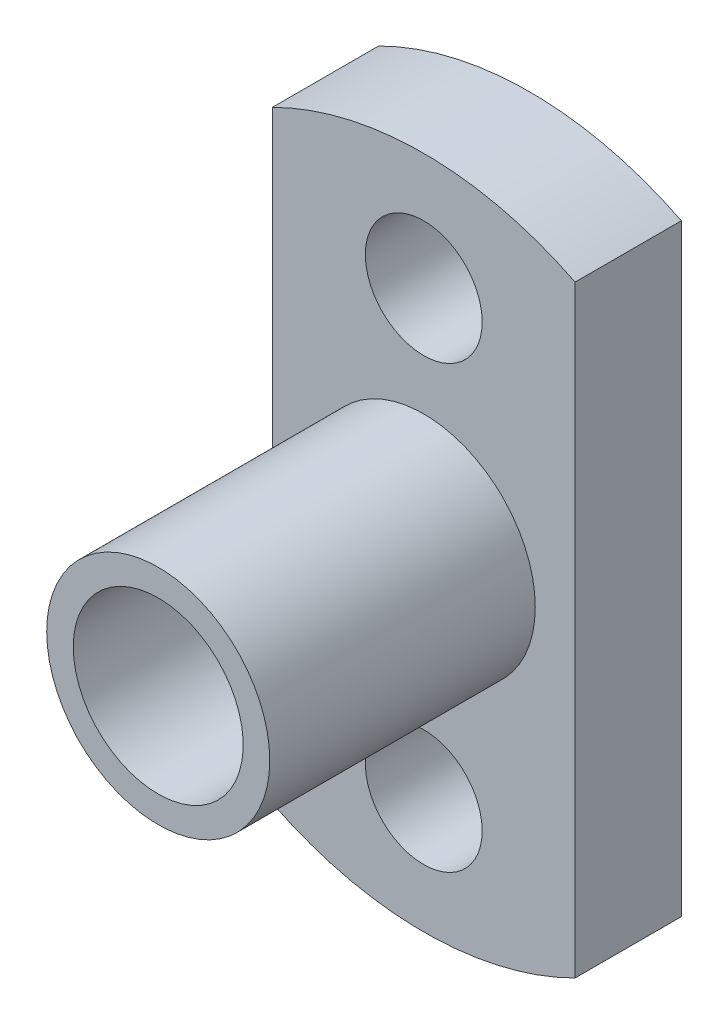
ISO-10303-21;
HEADER;
FILE_DESCRIPTION(('STEP AP214'),'2;1');
FILE_NAME('part.step','',(''),(''),'','','');
FILE_SCHEMA(('AUTOMOTIVE_DESIGN { 1 0 10303 214 1 1 1 1 }'));
ENDSEC;
DATA;
#1=APPLICATION_CONTEXT('core data for automotive mechanical design processes');
#2=APPLICATION_PROTOCOL_DEFINITION('international standard','automotive_design',2000,#1);
#3=PRODUCT_CONTEXT('',#1,'mechanical');
#4=PRODUCT('Part','Part','',(#3));
#5=PRODUCT_RELATED_PRODUCT_CATEGORY('part','',(#4));
#6=PRODUCT_DEFINITION_FORMATION('','',#4);
#7=PRODUCT_DEFINITION_CONTEXT('part definition',#1,'design');
#8=PRODUCT_DEFINITION('design','',#6,#7);
#9=PRODUCT_DEFINITION_SHAPE('','',#8);
#10=(LENGTH_UNIT() NAMED_UNIT(*) SI_UNIT(.MILLI.,.METRE.));
#11=(NAMED_UNIT(*) PLANE_ANGLE_UNIT() SI_UNIT($,.RADIAN.));
#12=(NAMED_UNIT(*) SI_UNIT($,.STERADIAN.) SOLID_ANGLE_UNIT());
#13=UNCERTAINTY_MEASURE_WITH_UNIT(LENGTH_MEASURE(1.E-05),#10,'distance_accuracy_value','');
#14=(GEOMETRIC_REPRESENTATION_CONTEXT(3) GLOBAL_UNCERTAINTY_ASSIGNED_CONTEXT((#13)) GLOBAL_UNIT_ASSIGNED_CONTEXT((#10,
#11,#12)) REPRESENTATION_CONTEXT('',''));
#15=CARTESIAN_POINT('',(0.,0.,0.));
#16=DIRECTION('',(0.,0.,1.));
#17=DIRECTION('',(1.,0.,0.));
#18=AXIS2_PLACEMENT_3D('',#15,#16,#17);
#19=CARTESIAN_POINT('',(0.,0.,4.));
#20=DIRECTION('',(0.,0.,1.));
#21=DIRECTION('',(1.,0.,0.));
#22=AXIS2_PLACEMENT_3D('',#19,#20,#21);
#23=PLANE('',#22);
#24=CARTESIAN_POINT('',(0.,0.,4.));
#25=DIRECTION('',(0.,0.,-1.));
#26=DIRECTION('',(-1.,0.,0.));
#27=AXIS2_PLACEMENT_3D('',#24,#25,#26);
#28=CIRCLE('',#27,0.25);
#29=CARTESIAN_POINT('',(-0.25,0.,4.));
#30=VERTEX_POINT('',#29);
#31=EDGE_CURVE('E19',#30,#30,#28,.T.);
#32=ORIENTED_EDGE('',*,*,#31,.F.);
#33=EDGE_LOOP('',(#32));
#34=FACE_BOUND('',#33,.T.);
#35=ADVANCED_FACE('F16',(#34),#23,.T.);
#36=CARTESIAN_POINT('',(0.,0.,1.4));
#37=DIRECTION('',(0.,0.,-1.));
#38=DIRECTION('',(-1.,0.,0.));
#39=AXIS2_PLACEMENT_3D('',#36,#37,#38);
#40=PLANE('',#39);
#41=CARTESIAN_POINT('',(0.,0.,1.4));
#42=DIRECTION('',(0.,0.,-1.));
#43=DIRECTION('',(-1.,0.,0.));
#44=AXIS2_PLACEMENT_3D('',#41,#42,#43);
#45=CIRCLE('',#44,0.2);
#46=CARTESIAN_POINT('',(-0.2,0.,1.4));
#47=VERTEX_POINT('',#46);
#48=EDGE_CURVE('E122',#47,#47,#45,.T.);
#49=ORIENTED_EDGE('',*,*,#48,.T.);
#50=EDGE_LOOP('',(#49));
#51=FACE_BOUND('',#50,.T.);
#52=ADVANCED_FACE('F132',(#51),#40,.T.);
#53=CARTESIAN_POINT('',(0.,0.,4.));
#54=DIRECTION('',(0.,0.,-1.));
#55=DIRECTION('',(-1.,0.,0.));
#56=AXIS2_PLACEMENT_3D('',#53,#54,#55);
#57=CYLINDRICAL_SURFACE('',#56,0.25);
#58=CARTESIAN_POINT('',(0.,0.,2.));
#59=DIRECTION('',(0.,0.,-1.));
#60=DIRECTION('',(-1.,0.,0.));
#61=AXIS2_PLACEMENT_3D('',#58,#59,#60);
#62=CIRCLE('',#61,0.25);
#63=CARTESIAN_POINT('',(-0.25,0.,2.));
#64=VERTEX_POINT('',#63);
#65=EDGE_CURVE('E120',#64,#64,#62,.T.);
#66=ORIENTED_EDGE('',*,*,#65,.F.);
#67=EDGE_LOOP('',(#66));
#68=FACE_BOUND('',#67,.T.);
#69=ORIENTED_EDGE('',*,*,#31,.T.);
#70=EDGE_LOOP('',(#69));
#71=FACE_BOUND('',#70,.T.);
#72=ADVANCED_FACE('F129',(#68,#71),#57,.T.);
#73=CARTESIAN_POINT('',(0.,0.,1.4));
#74=DIRECTION('',(0.,0.,-1.));
#75=DIRECTION('',(-1.,0.,0.));
#76=AXIS2_PLACEMENT_3D('',#73,#74,#75);
#77=CYLINDRICAL_SURFACE('',#76,0.2);
#78=CARTESIAN_POINT('',(0.,0.,-0.1));
#79=DIRECTION('',(0.,0.,-1.));
#80=DIRECTION('',(-1.,0.,0.));
#81=AXIS2_PLACEMENT_3D('',#78,#79,#80);
#82=CIRCLE('',#81,0.2);
#83=CARTESIAN_POINT('',(-0.2,0.,-0.1));
#84=VERTEX_POINT('',#83);
#85=EDGE_CURVE('E117',#84,#84,#82,.F.);
#86=ORIENTED_EDGE('',*,*,#85,.F.);
#87=EDGE_LOOP('',(#86));
#88=FACE_BOUND('',#87,.T.);
#89=ORIENTED_EDGE('',*,*,#48,.F.);
#90=EDGE_LOOP('',(#89));
#91=FACE_BOUND('',#90,.T.);
#92=ADVANCED_FACE('F189',(#88,#91),#77,.F.);
#93=CARTESIAN_POINT('',(0.,0.,2.));
#94=DIRECTION('',(0.,0.,1.));
#95=DIRECTION('',(1.,0.,0.));
#96=AXIS2_PLACEMENT_3D('',#93,#94,#95);
#97=PLANE('',#96);
#98=CARTESIAN_POINT('',(0.,0.,2.));
#99=DIRECTION('',(0.,0.,-1.));
#100=DIRECTION('',(-1.,0.,0.));
#101=AXIS2_PLACEMENT_3D('',#98,#99,#100);
#102=CIRCLE('',#101,1.6);
#103=CARTESIAN_POINT('',(-1.6,0.,2.));
#104=VERTEX_POINT('',#103);
#105=EDGE_CURVE('E114',#104,#104,#102,.F.);
#106=ORIENTED_EDGE('',*,*,#105,.T.);
#107=EDGE_LOOP('',(#106));
#108=FACE_BOUND('',#107,.T.);
#109=ORIENTED_EDGE('',*,*,#65,.T.);
#110=EDGE_LOOP('',(#109));
#111=FACE_BOUND('',#110,.T.);
#112=ADVANCED_FACE('F185',(#108,#111),#97,.T.);
#113=CARTESIAN_POINT('',(0.,0.,-0.1));
#114=DIRECTION('',(0.,0.,-1.));
#115=DIRECTION('',(-1.,0.,0.));
#116=AXIS2_PLACEMENT_3D('',#113,#114,#115);
#117=PLANE('',#116);
#118=CARTESIAN_POINT('',(0.,0.,-0.1));
#119=DIRECTION('',(0.,0.,1.));
#120=DIRECTION('',(1.,0.,0.));
#121=AXIS2_PLACEMENT_3D('',#118,#119,#120);
#122=CIRCLE('',#121,2.1);
#123=CARTESIAN_POINT('',(2.1,0.,-0.1));
#124=VERTEX_POINT('',#123);
#125=EDGE_CURVE('E111',#124,#124,#122,.T.);
#126=ORIENTED_EDGE('',*,*,#125,.F.);
#127=EDGE_LOOP('',(#126));
#128=FACE_BOUND('',#127,.T.);
#129=ORIENTED_EDGE('',*,*,#85,.T.);
#130=EDGE_LOOP('',(#129));
#131=FACE_BOUND('',#130,.T.);
#132=ADVANCED_FACE('F181',(#128,#131),#117,.T.);
#133=CARTESIAN_POINT('',(0.,0.,7.));
#134=DIRECTION('',(0.,0.,-1.));
#135=DIRECTION('',(-1.,0.,0.));
#136=AXIS2_PLACEMENT_3D('',#133,#134,#135);
#137=CYLINDRICAL_SURFACE('',#136,1.6);
#138=CARTESIAN_POINT('',(0.,0.,7.));
#139=DIRECTION('',(0.,0.,-1.));
#140=DIRECTION('',(-1.,0.,0.));
#141=AXIS2_PLACEMENT_3D('',#138,#139,#140);
#142=CIRCLE('',#141,1.6);
#143=CARTESIAN_POINT('',(-1.6,0.,7.));
#144=VERTEX_POINT('',#143);
#145=EDGE_CURVE('E108',#144,#144,#142,.T.);
#146=ORIENTED_EDGE('',*,*,#145,.F.);
#147=EDGE_LOOP('',(#146));
#148=FACE_BOUND('',#147,.T.);
#149=ORIENTED_EDGE('',*,*,#105,.F.);
#150=EDGE_LOOP('',(#149));
#151=FACE_BOUND('',#150,.T.);
#152=ADVANCED_FACE('F177',(#148,#151),#137,.F.);
#153=CARTESIAN_POINT('',(0.,0.,-0.1));
#154=DIRECTION('',(0.,0.,1.));
#155=DIRECTION('',(1.,0.,0.));
#156=AXIS2_PLACEMENT_3D('',#153,#154,#155);
#157=CYLINDRICAL_SURFACE('',#156,2.1);
#158=ORIENTED_EDGE('',*,*,#125,.T.);
#159=EDGE_LOOP('',(#158));
#160=FACE_BOUND('',#159,.T.);
#161=CARTESIAN_POINT('',(0.,0.,0.));
#162=DIRECTION('',(0.,0.,1.));
#163=DIRECTION('',(1.,0.,0.));
#164=AXIS2_PLACEMENT_3D('',#161,#162,#163);
#165=CIRCLE('',#164,2.1);
#166=CARTESIAN_POINT('',(2.1,0.,0.));
#167=VERTEX_POINT('',#166);
#168=EDGE_CURVE('E105',#167,#167,#165,.F.);
#169=ORIENTED_EDGE('',*,*,#168,.T.);
#170=EDGE_LOOP('',(#169));
#171=FACE_BOUND('',#170,.T.);
#172=ADVANCED_FACE('F173',(#160,#171),#157,.T.);
#173=CARTESIAN_POINT('',(0.,0.,7.));
#174=DIRECTION('',(0.,0.,1.));
#175=DIRECTION('',(1.,0.,0.));
#176=AXIS2_PLACEMENT_3D('',#173,#174,#175);
#177=PLANE('',#176);
#178=ORIENTED_EDGE('',*,*,#145,.T.);
#179=EDGE_LOOP('',(#178));
#180=FACE_BOUND('',#179,.T.);
#181=CARTESIAN_POINT('',(0.,0.,7.));
#182=DIRECTION('',(0.,0.,-1.));
#183=DIRECTION('',(-1.,0.,0.));
#184=AXIS2_PLACEMENT_3D('',#181,#182,#183);
#185=CIRCLE('',#184,2.1);
#186=CARTESIAN_POINT('',(-2.1,0.,7.));
#187=VERTEX_POINT('',#186);
#188=EDGE_CURVE('E66',#187,#187,#185,.T.);
#189=ORIENTED_EDGE('',*,*,#188,.F.);
#190=EDGE_LOOP('',(#189));
#191=FACE_BOUND('',#190,.T.);
#192=ADVANCED_FACE('F170',(#180,#191),#177,.T.);
#193=CARTESIAN_POINT('',(0.,0.,0.));
#194=DIRECTION('',(0.,0.,1.));
#195=DIRECTION('',(1.,0.,0.));
#196=AXIS2_PLACEMENT_3D('',#193,#194,#195);
#197=PLANE('',#196);
#198=DIRECTION('',(0.,1.,0.));
#199=VECTOR('',#198,1.);
#200=CARTESIAN_POINT('',(2.85,-5.67450438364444,0.));
#201=LINE('',#200,#199);
#202=CARTESIAN_POINT('',(2.85,5.67450438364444,0.));
#203=VERTEX_POINT('',#202);
#204=CARTESIAN_POINT('',(2.85,-5.67450438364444,0.));
#205=VERTEX_POINT('',#204);
#206=EDGE_CURVE('E60',#203,#205,#201,.F.);
#207=ORIENTED_EDGE('',*,*,#206,.T.);
#208=CARTESIAN_POINT('',(0.,0.,0.));
#209=DIRECTION('',(0.,0.,-1.));
#210=DIRECTION('',(-1.,0.,0.));
#211=AXIS2_PLACEMENT_3D('',#208,#209,#210);
#212=CIRCLE('',#211,6.35);
#213=CARTESIAN_POINT('',(-2.85,-5.67450438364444,0.));
#214=VERTEX_POINT('',#213);
#215=EDGE_CURVE('E85',#214,#205,#212,.F.);
#216=ORIENTED_EDGE('',*,*,#215,.F.);
#217=DIRECTION('',(0.,1.,0.));
#218=VECTOR('',#217,1.);
#219=CARTESIAN_POINT('',(-2.85,-5.67450438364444,0.));
#220=LINE('',#219,#218);
#221=CARTESIAN_POINT('',(-2.85,5.67450438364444,0.));
#222=VERTEX_POINT('',#221);
#223=EDGE_CURVE('E62',#214,#222,#220,.T.);
#224=ORIENTED_EDGE('',*,*,#223,.T.);
#225=CARTESIAN_POINT('',(0.,0.,0.));
#226=DIRECTION('',(0.,0.,-1.));
#227=DIRECTION('',(-1.,0.,0.));
#228=AXIS2_PLACEMENT_3D('',#225,#226,#227);
#229=CIRCLE('',#228,6.35);
#230=EDGE_CURVE('E55',#203,#222,#229,.F.);
#231=ORIENTED_EDGE('',*,*,#230,.F.);
#232=EDGE_LOOP('',(#207,#216,#224,#231));
#233=FACE_BOUND('',#232,.T.);
#234=CARTESIAN_POINT('',(0.,4.15,0.));
#235=DIRECTION('',(0.,0.,1.));
#236=DIRECTION('',(1.,0.,0.));
#237=AXIS2_PLACEMENT_3D('',#234,#235,#236);
#238=CIRCLE('',#237,1.1);
#239=CARTESIAN_POINT('',(1.1,4.15,0.));
#240=VERTEX_POINT('',#239);
#241=EDGE_CURVE('E99',#240,#240,#238,.T.);
#242=ORIENTED_EDGE('',*,*,#241,.T.);
#243=EDGE_LOOP('',(#242));
#244=FACE_BOUND('',#243,.T.);
#245=CARTESIAN_POINT('',(0.,-4.15,0.));
#246=DIRECTION('',(0.,0.,1.));
#247=DIRECTION('',(1.,0.,0.));
#248=AXIS2_PLACEMENT_3D('',#245,#246,#247);
#249=CIRCLE('',#248,1.1);
#250=CARTESIAN_POINT('',(1.1,-4.15,0.));
#251=VERTEX_POINT('',#250);
#252=EDGE_CURVE('E102',#251,#251,#249,.T.);
#253=ORIENTED_EDGE('',*,*,#252,.T.);
#254=EDGE_LOOP('',(#253));
#255=FACE_BOUND('',#254,.T.);
#256=ORIENTED_EDGE('',*,*,#168,.F.);
#257=EDGE_LOOP('',(#256));
#258=FACE_BOUND('',#257,.T.);
#259=ADVANCED_FACE('F57',(#233,#244,#255,#258),#197,.F.);
#260=CARTESIAN_POINT('',(0.,-4.15,0.));
#261=DIRECTION('',(0.,0.,1.));
#262=DIRECTION('',(1.,0.,0.));
#263=AXIS2_PLACEMENT_3D('',#260,#261,#262);
#264=CYLINDRICAL_SURFACE('',#263,1.1);
#265=CARTESIAN_POINT('',(0.,-4.15,2.));
#266=DIRECTION('',(0.,0.,1.));
#267=DIRECTION('',(1.,0.,0.));
#268=AXIS2_PLACEMENT_3D('',#265,#266,#267);
#269=CIRCLE('',#268,1.1);
#270=CARTESIAN_POINT('',(1.1,-4.15,2.));
#271=VERTEX_POINT('',#270);
#272=EDGE_CURVE('E76',#271,#271,#269,.F.);
#273=ORIENTED_EDGE('',*,*,#272,.F.);
#274=EDGE_LOOP('',(#273));
#275=FACE_BOUND('',#274,.T.);
#276=ORIENTED_EDGE('',*,*,#252,.F.);
#277=EDGE_LOOP('',(#276));
#278=FACE_BOUND('',#277,.T.);
#279=ADVANCED_FACE('F163',(#275,#278),#264,.F.);
#280=CARTESIAN_POINT('',(0.,4.15,0.));
#281=DIRECTION('',(0.,0.,1.));
#282=DIRECTION('',(1.,0.,0.));
#283=AXIS2_PLACEMENT_3D('',#280,#281,#282);
#284=CYLINDRICAL_SURFACE('',#283,1.1);
#285=CARTESIAN_POINT('',(0.,4.15,2.));
#286=DIRECTION('',(0.,0.,1.));
#287=DIRECTION('',(1.,0.,0.));
#288=AXIS2_PLACEMENT_3D('',#285,#286,#287);
#289=CIRCLE('',#288,1.1);
#290=CARTESIAN_POINT('',(1.1,4.15,2.));
#291=VERTEX_POINT('',#290);
#292=EDGE_CURVE('E79',#291,#291,#289,.F.);
#293=ORIENTED_EDGE('',*,*,#292,.F.);
#294=EDGE_LOOP('',(#293));
#295=FACE_BOUND('',#294,.T.);
#296=ORIENTED_EDGE('',*,*,#241,.F.);
#297=EDGE_LOOP('',(#296));
#298=FACE_BOUND('',#297,.T.);
#299=ADVANCED_FACE('F159',(#295,#298),#284,.F.);
#300=CARTESIAN_POINT('',(0.,0.,7.));
#301=DIRECTION('',(0.,0.,-1.));
#302=DIRECTION('',(-1.,0.,0.));
#303=AXIS2_PLACEMENT_3D('',#300,#301,#302);
#304=CYLINDRICAL_SURFACE('',#303,2.1);
#305=CARTESIAN_POINT('',(0.,0.,2.));
#306=DIRECTION('',(0.,0.,-1.));
#307=DIRECTION('',(-1.,0.,0.));
#308=AXIS2_PLACEMENT_3D('',#305,#306,#307);
#309=CIRCLE('',#308,2.1);
#310=CARTESIAN_POINT('',(-2.1,0.,2.));
#311=VERTEX_POINT('',#310);
#312=EDGE_CURVE('E90',#311,#311,#309,.T.);
#313=ORIENTED_EDGE('',*,*,#312,.F.);
#314=EDGE_LOOP('',(#313));
#315=FACE_BOUND('',#314,.T.);
#316=ORIENTED_EDGE('',*,*,#188,.T.);
#317=EDGE_LOOP('',(#316));
#318=FACE_BOUND('',#317,.T.);
#319=ADVANCED_FACE('F156',(#315,#318),#304,.T.);
#320=CARTESIAN_POINT('',(0.,0.,2.));
#321=DIRECTION('',(0.,0.,-1.));
#322=DIRECTION('',(-1.,0.,0.));
#323=AXIS2_PLACEMENT_3D('',#320,#321,#322);
#324=CYLINDRICAL_SURFACE('',#323,6.35);
#325=CARTESIAN_POINT('',(0.,0.,2.));
#326=DIRECTION('',(0.,0.,-1.));
#327=DIRECTION('',(-1.,0.,0.));
#328=AXIS2_PLACEMENT_3D('',#325,#326,#327);
#329=CIRCLE('',#328,6.35);
#330=CARTESIAN_POINT('',(2.85,5.67450438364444,2.));
#331=VERTEX_POINT('',#330);
#332=CARTESIAN_POINT('',(-2.85,5.67450438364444,2.));
#333=VERTEX_POINT('',#332);
#334=EDGE_CURVE('E72',#331,#333,#329,.F.);
#335=ORIENTED_EDGE('',*,*,#334,.F.);
#336=DIRECTION('',(0.,0.,1.));
#337=VECTOR('',#336,1.);
#338=CARTESIAN_POINT('',(2.85,5.67450438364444,2.));
#339=LINE('',#338,#337);
#340=EDGE_CURVE('E69',#331,#203,#339,.F.);
#341=ORIENTED_EDGE('',*,*,#340,.T.);
#342=ORIENTED_EDGE('',*,*,#230,.T.);
#343=DIRECTION('',(0.,0.,-1.));
#344=VECTOR('',#343,1.);
#345=CARTESIAN_POINT('',(-2.85,5.67450438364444,2.));
#346=LINE('',#345,#344);
#347=EDGE_CURVE('E65',#222,#333,#346,.F.);
#348=ORIENTED_EDGE('',*,*,#347,.T.);
#349=EDGE_LOOP('',(#335,#341,#342,#348));
#350=FACE_BOUND('',#349,.T.);
#351=ADVANCED_FACE('F70',(#350),#324,.T.);
#352=CARTESIAN_POINT('',(-2.85,-5.67450438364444,2.));
#353=DIRECTION('',(1.,0.,0.));
#354=DIRECTION('',(0.,0.,-1.));
#355=AXIS2_PLACEMENT_3D('',#352,#353,#354);
#356=PLANE('',#355);
#357=DIRECTION('',(0.,0.,-1.));
#358=VECTOR('',#357,1.);
#359=CARTESIAN_POINT('',(-2.85,-5.67450438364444,2.));
#360=LINE('',#359,#358);
#361=CARTESIAN_POINT('',(-2.85,-5.67450438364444,2.));
#362=VERTEX_POINT('',#361);
#363=EDGE_CURVE('E95',#362,#214,#360,.T.);
#364=ORIENTED_EDGE('',*,*,#363,.F.);
#365=DIRECTION('',(0.,1.,0.));
#366=VECTOR('',#365,1.);
#367=CARTESIAN_POINT('',(-2.85,0.,2.));
#368=LINE('',#367,#366);
#369=EDGE_CURVE('E88',#333,#362,#368,.F.);
#370=ORIENTED_EDGE('',*,*,#369,.F.);
#371=ORIENTED_EDGE('',*,*,#347,.F.);
#372=ORIENTED_EDGE('',*,*,#223,.F.);
#373=EDGE_LOOP('',(#364,#370,#371,#372));
#374=FACE_BOUND('',#373,.T.);
#375=ADVANCED_FACE('F150',(#374),#356,.F.);
#376=CARTESIAN_POINT('',(0.,0.,2.));
#377=DIRECTION('',(0.,0.,-1.));
#378=DIRECTION('',(-1.,0.,0.));
#379=AXIS2_PLACEMENT_3D('',#376,#377,#378);
#380=CYLINDRICAL_SURFACE('',#379,6.35);
#381=CARTESIAN_POINT('',(0.,0.,2.));
#382=DIRECTION('',(0.,0.,-1.));
#383=DIRECTION('',(-1.,0.,0.));
#384=AXIS2_PLACEMENT_3D('',#381,#382,#383);
#385=CIRCLE('',#384,6.35);
#386=CARTESIAN_POINT('',(2.85,-5.67450438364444,2.));
#387=VERTEX_POINT('',#386);
#388=EDGE_CURVE('E25',#362,#387,#385,.F.);
#389=ORIENTED_EDGE('',*,*,#388,.F.);
#390=ORIENTED_EDGE('',*,*,#363,.T.);
#391=ORIENTED_EDGE('',*,*,#215,.T.);
#392=DIRECTION('',(0.,0.,1.));
#393=VECTOR('',#392,1.);
#394=CARTESIAN_POINT('',(2.85,-5.67450438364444,2.));
#395=LINE('',#394,#393);
#396=EDGE_CURVE('E34',#205,#387,#395,.T.);
#397=ORIENTED_EDGE('',*,*,#396,.T.);
#398=EDGE_LOOP('',(#389,#390,#391,#397));
#399=FACE_BOUND('',#398,.T.);
#400=ADVANCED_FACE('F144',(#399),#380,.T.);
#401=CARTESIAN_POINT('',(2.85,-5.67450438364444,2.));
#402=DIRECTION('',(-1.,0.,0.));
#403=DIRECTION('',(0.,0.,1.));
#404=AXIS2_PLACEMENT_3D('',#401,#402,#403);
#405=PLANE('',#404);
#406=ORIENTED_EDGE('',*,*,#340,.F.);
#407=DIRECTION('',(0.,1.,0.));
#408=VECTOR('',#407,1.);
#409=CARTESIAN_POINT('',(2.85,0.,2.));
#410=LINE('',#409,#408);
#411=EDGE_CURVE('E10',#387,#331,#410,.T.);
#412=ORIENTED_EDGE('',*,*,#411,.F.);
#413=ORIENTED_EDGE('',*,*,#396,.F.);
#414=ORIENTED_EDGE('',*,*,#206,.F.);
#415=EDGE_LOOP('',(#406,#412,#413,#414));
#416=FACE_BOUND('',#415,.T.);
#417=ADVANCED_FACE('F75',(#416),#405,.F.);
#418=CARTESIAN_POINT('',(0.,0.,2.));
#419=DIRECTION('',(0.,0.,1.));
#420=DIRECTION('',(1.,0.,0.));
#421=AXIS2_PLACEMENT_3D('',#418,#419,#420);
#422=PLANE('',#421);
#423=ORIENTED_EDGE('',*,*,#388,.T.);
#424=ORIENTED_EDGE('',*,*,#411,.T.);
#425=ORIENTED_EDGE('',*,*,#334,.T.);
#426=ORIENTED_EDGE('',*,*,#369,.T.);
#427=EDGE_LOOP('',(#423,#424,#425,#426));
#428=FACE_BOUND('',#427,.T.);
#429=ORIENTED_EDGE('',*,*,#312,.T.);
#430=EDGE_LOOP('',(#429));
#431=FACE_BOUND('',#430,.T.);
#432=ORIENTED_EDGE('',*,*,#292,.T.);
#433=EDGE_LOOP('',(#432));
#434=FACE_BOUND('',#433,.T.);
#435=ORIENTED_EDGE('',*,*,#272,.T.);
#436=EDGE_LOOP('',(#435));
#437=FACE_BOUND('',#436,.T.);
#438=ADVANCED_FACE('F137',(#428,#431,#434,#437),#422,.T.);
#439=CLOSED_SHELL('',(#35,#52,#72,#92,#112,#132,#152,#172,#192,#259,#279,#299,#319,#351,#375,
#400,#417,#438));
#440=MANIFOLD_SOLID_BREP('B1',#439);
#441=ADVANCED_BREP_SHAPE_REPRESENTATION('',(#18,#440),#14);
#442=SHAPE_DEFINITION_REPRESENTATION(#9,#441);
ENDSEC;
END-ISO-10303-21;
